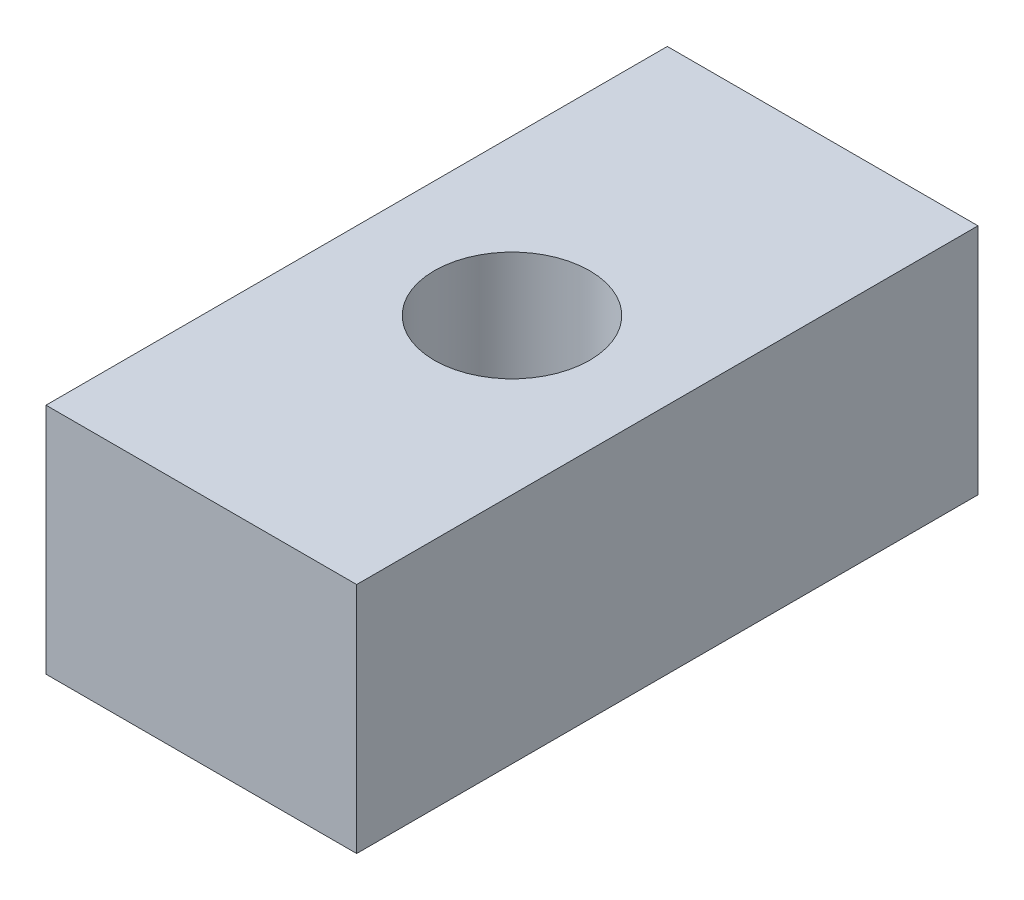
from build123d import *

# Parameters (mm, degrees)
SKETCH1_W          = 25.4
SKETCH1_H          = 50.8
EXTRUDE1_DEPTH     = 19.05
SKETCH2_R          = 6.35
CUT_EXTRUDE1_DEPTH = 12.7


with BuildPart() as part:
    # Sketch1 → Extrude1 (new body)
    with BuildSketch(Plane(origin=(0, 0, 0), x_dir=(1, 0, 0), z_dir=(0, 1, 0))):
        Rectangle(SKETCH1_W, SKETCH1_H)
    extrude(amount=EXTRUDE1_DEPTH)

    # Sketch2 → Cut-Extrude1 (cut)
    with BuildSketch(Plane(origin=(0, 19.05, 0), x_dir=(-1, 0, 0), z_dir=(0, 1, 0))):
        with Locations(Location((0, 0, 0), (0, 0, 90))):
            Circle(SKETCH2_R)
    extrude(amount=-CUT_EXTRUDE1_DEPTH, mode=Mode.SUBTRACT)


solid = part.part
